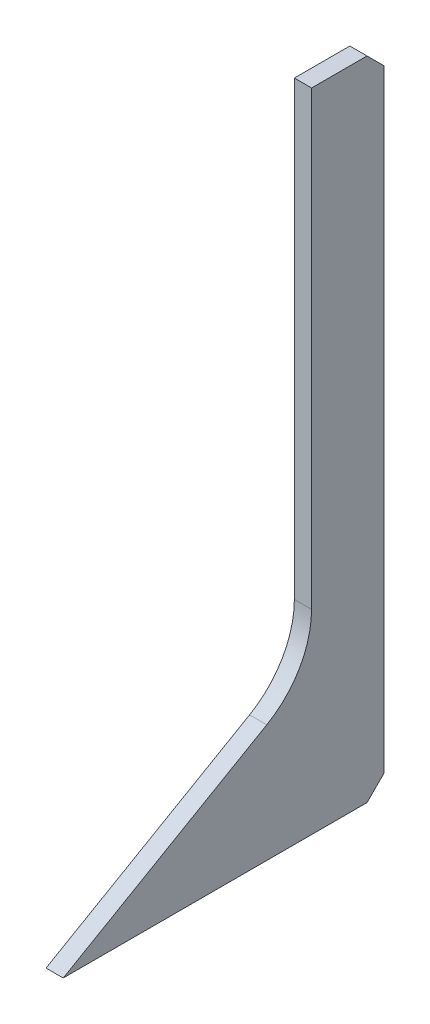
ISO-10303-21;
HEADER;
FILE_DESCRIPTION(('STEP AP214'),'2;1');
FILE_NAME('part.step','',(''),(''),'','','');
FILE_SCHEMA(('AUTOMOTIVE_DESIGN { 1 0 10303 214 1 1 1 1 }'));
ENDSEC;
DATA;
#1=APPLICATION_CONTEXT('core data for automotive mechanical design processes');
#2=APPLICATION_PROTOCOL_DEFINITION('international standard','automotive_design',2000,#1);
#3=PRODUCT_CONTEXT('',#1,'mechanical');
#4=PRODUCT('Part','Part','',(#3));
#5=PRODUCT_RELATED_PRODUCT_CATEGORY('part','',(#4));
#6=PRODUCT_DEFINITION_FORMATION('','',#4);
#7=PRODUCT_DEFINITION_CONTEXT('part definition',#1,'design');
#8=PRODUCT_DEFINITION('design','',#6,#7);
#9=PRODUCT_DEFINITION_SHAPE('','',#8);
#10=(LENGTH_UNIT() NAMED_UNIT(*) SI_UNIT(.MILLI.,.METRE.));
#11=(NAMED_UNIT(*) PLANE_ANGLE_UNIT() SI_UNIT($,.RADIAN.));
#12=(NAMED_UNIT(*) SI_UNIT($,.STERADIAN.) SOLID_ANGLE_UNIT());
#13=UNCERTAINTY_MEASURE_WITH_UNIT(LENGTH_MEASURE(1.E-05),#10,'distance_accuracy_value','');
#14=(GEOMETRIC_REPRESENTATION_CONTEXT(3) GLOBAL_UNCERTAINTY_ASSIGNED_CONTEXT((#13)) GLOBAL_UNIT_ASSIGNED_CONTEXT((#10,
#11,#12)) REPRESENTATION_CONTEXT('',''));
#15=CARTESIAN_POINT('',(0.,0.,0.));
#16=DIRECTION('',(0.,0.,1.));
#17=DIRECTION('',(1.,0.,0.));
#18=AXIS2_PLACEMENT_3D('',#15,#16,#17);
#19=CARTESIAN_POINT('',(384.582330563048,40.4827469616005,-255.534999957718));
#20=DIRECTION('',(0.,-1.,0.));
#21=DIRECTION('',(0.,0.,-1.));
#22=AXIS2_PLACEMENT_3D('',#19,#20,#21);
#23=PLANE('',#22);
#24=DIRECTION('',(1.,0.,0.));
#25=VECTOR('',#24,1.);
#26=CARTESIAN_POINT('',(384.582330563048,40.4827469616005,-253.534999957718));
#27=LINE('',#26,#25);
#28=CARTESIAN_POINT('',(384.582330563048,40.4827469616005,-253.534999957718));
#29=VERTEX_POINT('',#28);
#30=CARTESIAN_POINT('',(387.630330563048,40.4827469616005,-253.534999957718));
#31=VERTEX_POINT('',#30);
#32=EDGE_CURVE('E101',#29,#31,#27,.T.);
#33=ORIENTED_EDGE('',*,*,#32,.T.);
#34=DIRECTION('',(0.,0.,-1.));
#35=VECTOR('',#34,1.);
#36=CARTESIAN_POINT('',(387.630330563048,40.4827469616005,-255.534999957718));
#37=LINE('',#36,#35);
#38=CARTESIAN_POINT('',(387.630330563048,40.4827469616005,-199.713909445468));
#39=VERTEX_POINT('',#38);
#40=EDGE_CURVE('E121',#39,#31,#37,.T.);
#41=ORIENTED_EDGE('',*,*,#40,.F.);
#42=DIRECTION('',(1.,0.,0.));
#43=VECTOR('',#42,1.);
#44=CARTESIAN_POINT('',(384.582330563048,40.4827469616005,-199.713909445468));
#45=LINE('',#44,#43);
#46=CARTESIAN_POINT('',(384.582330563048,40.4827469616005,-199.713909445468));
#47=VERTEX_POINT('',#46);
#48=EDGE_CURVE('E146',#47,#39,#45,.T.);
#49=ORIENTED_EDGE('',*,*,#48,.F.);
#50=DIRECTION('',(0.,0.,-1.));
#51=VECTOR('',#50,1.);
#52=CARTESIAN_POINT('',(384.582330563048,40.4827469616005,-255.534999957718));
#53=LINE('',#52,#51);
#54=EDGE_CURVE('E135',#47,#29,#53,.T.);
#55=ORIENTED_EDGE('',*,*,#54,.T.);
#56=EDGE_LOOP('',(#33,#41,#49,#55));
#57=FACE_BOUND('',#56,.T.);
#58=ADVANCED_FACE('F35',(#57),#23,.T.);
#59=CARTESIAN_POINT('',(384.582330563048,65.8827469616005,-243.707999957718));
#60=DIRECTION('',(0.,0.866025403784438,0.500000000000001));
#61=DIRECTION('',(0.,-0.500000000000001,0.866025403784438));
#62=AXIS2_PLACEMENT_3D('',#59,#60,#61);
#63=PLANE('',#62);
#64=DIRECTION('',(0.,-0.500000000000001,0.866025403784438));
#65=VECTOR('',#64,1.);
#66=CARTESIAN_POINT('',(387.630330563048,65.8827469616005,-243.707999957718));
#67=LINE('',#66,#65);
#68=CARTESIAN_POINT('',(387.630330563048,61.3000291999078,-235.770499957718));
#69=VERTEX_POINT('',#68);
#70=EDGE_CURVE('E126',#69,#39,#67,.T.);
#71=ORIENTED_EDGE('',*,*,#70,.F.);
#72=DIRECTION('',(1.,0.,0.));
#73=VECTOR('',#72,1.);
#74=CARTESIAN_POINT('',(384.582330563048,61.3000291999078,-235.770499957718));
#75=LINE('',#74,#73);
#76=CARTESIAN_POINT('',(384.582330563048,61.3000291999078,-235.770499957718));
#77=VERTEX_POINT('',#76);
#78=EDGE_CURVE('E154',#69,#77,#75,.F.);
#79=ORIENTED_EDGE('',*,*,#78,.T.);
#80=DIRECTION('',(0.,-0.500000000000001,0.866025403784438));
#81=VECTOR('',#80,1.);
#82=CARTESIAN_POINT('',(384.582330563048,65.8827469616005,-243.707999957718));
#83=LINE('',#82,#81);
#84=EDGE_CURVE('E133',#77,#47,#83,.T.);
#85=ORIENTED_EDGE('',*,*,#84,.T.);
#86=ORIENTED_EDGE('',*,*,#48,.T.);
#87=EDGE_LOOP('',(#71,#79,#85,#86));
#88=FACE_BOUND('',#87,.T.);
#89=ADVANCED_FACE('F163',(#88),#63,.T.);
#90=CARTESIAN_POINT('',(384.582330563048,155.0367469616,-243.707999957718));
#91=DIRECTION('',(0.,0.,1.));
#92=DIRECTION('',(1.,0.,0.));
#93=AXIS2_PLACEMENT_3D('',#90,#91,#92);
#94=PLANE('',#93);
#95=DIRECTION('',(0.,-1.,0.));
#96=VECTOR('',#95,1.);
#97=CARTESIAN_POINT('',(384.582330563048,155.0367469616,-243.707999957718));
#98=LINE('',#97,#96);
#99=CARTESIAN_POINT('',(384.582330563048,155.0367469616,-243.707999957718));
#100=VERTEX_POINT('',#99);
#101=CARTESIAN_POINT('',(384.582330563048,75.0481824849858,-243.707999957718));
#102=VERTEX_POINT('',#101);
#103=EDGE_CURVE('E123',#100,#102,#98,.T.);
#104=ORIENTED_EDGE('',*,*,#103,.T.);
#105=DIRECTION('',(1.,0.,0.));
#106=VECTOR('',#105,1.);
#107=CARTESIAN_POINT('',(387.630330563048,75.0481824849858,-243.707999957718));
#108=LINE('',#107,#106);
#109=CARTESIAN_POINT('',(387.630330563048,75.0481824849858,-243.707999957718));
#110=VERTEX_POINT('',#109);
#111=EDGE_CURVE('E149',#102,#110,#108,.T.);
#112=ORIENTED_EDGE('',*,*,#111,.T.);
#113=DIRECTION('',(0.,-1.,0.));
#114=VECTOR('',#113,1.);
#115=CARTESIAN_POINT('',(387.630330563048,155.0367469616,-243.707999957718));
#116=LINE('',#115,#114);
#117=CARTESIAN_POINT('',(387.630330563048,155.0367469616,-243.707999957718));
#118=VERTEX_POINT('',#117);
#119=EDGE_CURVE('E142',#118,#110,#116,.T.);
#120=ORIENTED_EDGE('',*,*,#119,.F.);
#121=DIRECTION('',(1.,0.,0.));
#122=VECTOR('',#121,1.);
#123=CARTESIAN_POINT('',(384.582330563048,155.0367469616,-243.707999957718));
#124=LINE('',#123,#122);
#125=EDGE_CURVE('E137',#100,#118,#124,.T.);
#126=ORIENTED_EDGE('',*,*,#125,.F.);
#127=EDGE_LOOP('',(#104,#112,#120,#126));
#128=FACE_BOUND('',#127,.T.);
#129=ADVANCED_FACE('F171',(#128),#94,.T.);
#130=CARTESIAN_POINT('',(384.582330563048,155.0367469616,-243.707999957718));
#131=DIRECTION('',(0.,1.,0.));
#132=DIRECTION('',(0.,0.,1.));
#133=AXIS2_PLACEMENT_3D('',#130,#131,#132);
#134=PLANE('',#133);
#135=DIRECTION('',(1.,0.,0.));
#136=VECTOR('',#135,1.);
#137=CARTESIAN_POINT('',(384.582330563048,155.0367469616,-253.534999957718));
#138=LINE('',#137,#136);
#139=CARTESIAN_POINT('',(384.582330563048,155.0367469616,-253.534999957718));
#140=VERTEX_POINT('',#139);
#141=CARTESIAN_POINT('',(387.630330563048,155.0367469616,-253.534999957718));
#142=VERTEX_POINT('',#141);
#143=EDGE_CURVE('E58',#140,#142,#138,.T.);
#144=ORIENTED_EDGE('',*,*,#143,.F.);
#145=DIRECTION('',(0.,0.,1.));
#146=VECTOR('',#145,1.);
#147=CARTESIAN_POINT('',(384.582330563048,155.0367469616,-243.707999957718));
#148=LINE('',#147,#146);
#149=EDGE_CURVE('E120',#140,#100,#148,.T.);
#150=ORIENTED_EDGE('',*,*,#149,.T.);
#151=ORIENTED_EDGE('',*,*,#125,.T.);
#152=DIRECTION('',(0.,0.,1.));
#153=VECTOR('',#152,1.);
#154=CARTESIAN_POINT('',(387.630330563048,155.0367469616,-243.707999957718));
#155=LINE('',#154,#153);
#156=EDGE_CURVE('E139',#142,#118,#155,.T.);
#157=ORIENTED_EDGE('',*,*,#156,.F.);
#158=EDGE_LOOP('',(#144,#150,#151,#157));
#159=FACE_BOUND('',#158,.T.);
#160=ADVANCED_FACE('F174',(#159),#134,.T.);
#161=CARTESIAN_POINT('',(384.582330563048,154.0367469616,-256.534999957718));
#162=DIRECTION('',(0.,0.,-1.));
#163=DIRECTION('',(-1.,0.,0.));
#164=AXIS2_PLACEMENT_3D('',#161,#162,#163);
#165=PLANE('',#164);
#166=DIRECTION('',(1.,0.,0.));
#167=VECTOR('',#166,1.);
#168=CARTESIAN_POINT('',(384.582330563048,43.4827469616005,-256.534999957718));
#169=LINE('',#168,#167);
#170=CARTESIAN_POINT('',(384.582330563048,43.4827469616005,-256.534999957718));
#171=VERTEX_POINT('',#170);
#172=CARTESIAN_POINT('',(387.630330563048,43.4827469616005,-256.534999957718));
#173=VERTEX_POINT('',#172);
#174=EDGE_CURVE('E50',#171,#173,#169,.T.);
#175=ORIENTED_EDGE('',*,*,#174,.F.);
#176=DIRECTION('',(0.,1.,0.));
#177=VECTOR('',#176,1.);
#178=CARTESIAN_POINT('',(384.582330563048,154.0367469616,-256.534999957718));
#179=LINE('',#178,#177);
#180=CARTESIAN_POINT('',(384.582330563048,152.0367469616,-256.534999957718));
#181=VERTEX_POINT('',#180);
#182=EDGE_CURVE('E112',#171,#181,#179,.T.);
#183=ORIENTED_EDGE('',*,*,#182,.T.);
#184=DIRECTION('',(1.,0.,0.));
#185=VECTOR('',#184,1.);
#186=CARTESIAN_POINT('',(384.582330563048,152.0367469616,-256.534999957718));
#187=LINE('',#186,#185);
#188=CARTESIAN_POINT('',(387.630330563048,152.0367469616,-256.534999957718));
#189=VERTEX_POINT('',#188);
#190=EDGE_CURVE('E140',#181,#189,#187,.T.);
#191=ORIENTED_EDGE('',*,*,#190,.T.);
#192=DIRECTION('',(0.,1.,0.));
#193=VECTOR('',#192,1.);
#194=CARTESIAN_POINT('',(387.630330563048,154.0367469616,-256.534999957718));
#195=LINE('',#194,#193);
#196=EDGE_CURVE('E114',#173,#189,#195,.T.);
#197=ORIENTED_EDGE('',*,*,#196,.F.);
#198=EDGE_LOOP('',(#175,#183,#191,#197));
#199=FACE_BOUND('',#198,.T.);
#200=ADVANCED_FACE('F110',(#199),#165,.T.);
#201=CARTESIAN_POINT('',(384.582330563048,41.4827469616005,-255.534999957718));
#202=DIRECTION('',(1.,0.,0.));
#203=DIRECTION('',(0.,0.,-1.));
#204=AXIS2_PLACEMENT_3D('',#201,#202,#203);
#205=PLANE('',#204);
#206=ORIENTED_EDGE('',*,*,#182,.F.);
#207=DIRECTION('',(0.,-0.707106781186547,0.707106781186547));
#208=VECTOR('',#207,1.);
#209=CARTESIAN_POINT('',(384.582330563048,43.4827469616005,-256.534999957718));
#210=LINE('',#209,#208);
#211=EDGE_CURVE('E98',#171,#29,#210,.T.);
#212=ORIENTED_EDGE('',*,*,#211,.T.);
#213=ORIENTED_EDGE('',*,*,#54,.F.);
#214=ORIENTED_EDGE('',*,*,#84,.F.);
#215=CARTESIAN_POINT('',(384.582330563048,75.0481824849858,-227.832999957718));
#216=DIRECTION('',(1.,0.,0.));
#217=DIRECTION('',(0.,0.,-1.));
#218=AXIS2_PLACEMENT_3D('',#215,#216,#217);
#219=CIRCLE('',#218,15.875);
#220=EDGE_CURVE('E11',#77,#102,#219,.T.);
#221=ORIENTED_EDGE('',*,*,#220,.T.);
#222=ORIENTED_EDGE('',*,*,#103,.F.);
#223=ORIENTED_EDGE('',*,*,#149,.F.);
#224=DIRECTION('',(0.,-0.707106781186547,-0.707106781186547));
#225=VECTOR('',#224,1.);
#226=CARTESIAN_POINT('',(384.582330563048,155.0367469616,-253.534999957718));
#227=LINE('',#226,#225);
#228=EDGE_CURVE('E119',#140,#181,#227,.T.);
#229=ORIENTED_EDGE('',*,*,#228,.T.);
#230=EDGE_LOOP('',(#206,#212,#213,#214,#221,#222,#223,#229));
#231=FACE_BOUND('',#230,.T.);
#232=ADVANCED_FACE('F117',(#231),#205,.F.);
#233=CARTESIAN_POINT('',(387.630330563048,41.4827469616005,-255.534999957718));
#234=DIRECTION('',(1.,0.,0.));
#235=DIRECTION('',(0.,0.,-1.));
#236=AXIS2_PLACEMENT_3D('',#233,#234,#235);
#237=PLANE('',#236);
#238=DIRECTION('',(0.,-0.707106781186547,0.707106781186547));
#239=VECTOR('',#238,1.);
#240=CARTESIAN_POINT('',(387.630330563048,43.4827469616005,-256.534999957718));
#241=LINE('',#240,#239);
#242=EDGE_CURVE('E106',#173,#31,#241,.T.);
#243=ORIENTED_EDGE('',*,*,#242,.F.);
#244=ORIENTED_EDGE('',*,*,#196,.T.);
#245=DIRECTION('',(0.,-0.707106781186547,-0.707106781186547));
#246=VECTOR('',#245,1.);
#247=CARTESIAN_POINT('',(387.630330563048,155.0367469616,-253.534999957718));
#248=LINE('',#247,#246);
#249=EDGE_CURVE('E175',#142,#189,#248,.T.);
#250=ORIENTED_EDGE('',*,*,#249,.F.);
#251=ORIENTED_EDGE('',*,*,#156,.T.);
#252=ORIENTED_EDGE('',*,*,#119,.T.);
#253=CARTESIAN_POINT('',(387.630330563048,75.0481824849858,-227.832999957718));
#254=DIRECTION('',(1.,0.,0.));
#255=DIRECTION('',(0.,0.,-1.));
#256=AXIS2_PLACEMENT_3D('',#253,#254,#255);
#257=CIRCLE('',#256,15.875);
#258=EDGE_CURVE('E43',#110,#69,#257,.F.);
#259=ORIENTED_EDGE('',*,*,#258,.T.);
#260=ORIENTED_EDGE('',*,*,#70,.T.);
#261=ORIENTED_EDGE('',*,*,#40,.T.);
#262=EDGE_LOOP('',(#243,#244,#250,#251,#252,#259,#260,#261));
#263=FACE_BOUND('',#262,.T.);
#264=ADVANCED_FACE('F157',(#263),#237,.T.);
#265=CARTESIAN_POINT('',(384.582330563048,75.0481824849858,-227.832999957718));
#266=DIRECTION('',(-1.,0.,0.));
#267=DIRECTION('',(0.,0.,1.));
#268=AXIS2_PLACEMENT_3D('',#265,#266,#267);
#269=CYLINDRICAL_SURFACE('',#268,15.875);
#270=ORIENTED_EDGE('',*,*,#220,.F.);
#271=ORIENTED_EDGE('',*,*,#78,.F.);
#272=ORIENTED_EDGE('',*,*,#258,.F.);
#273=ORIENTED_EDGE('',*,*,#111,.F.);
#274=EDGE_LOOP('',(#270,#271,#272,#273));
#275=FACE_BOUND('',#274,.T.);
#276=ADVANCED_FACE('F37',(#275),#269,.F.);
#277=CARTESIAN_POINT('',(384.582330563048,155.0367469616,-253.534999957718));
#278=DIRECTION('',(0.,-0.707106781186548,0.707106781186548));
#279=DIRECTION('',(0.,-0.707106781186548,-0.707106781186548));
#280=AXIS2_PLACEMENT_3D('',#277,#278,#279);
#281=PLANE('',#280);
#282=ORIENTED_EDGE('',*,*,#249,.T.);
#283=ORIENTED_EDGE('',*,*,#190,.F.);
#284=ORIENTED_EDGE('',*,*,#228,.F.);
#285=ORIENTED_EDGE('',*,*,#143,.T.);
#286=EDGE_LOOP('',(#282,#283,#284,#285));
#287=FACE_BOUND('',#286,.T.);
#288=ADVANCED_FACE('F201',(#287),#281,.F.);
#289=CARTESIAN_POINT('',(384.582330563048,43.4827469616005,-256.534999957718));
#290=DIRECTION('',(0.,0.707106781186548,0.707106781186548));
#291=DIRECTION('',(0.,-0.707106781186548,0.707106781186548));
#292=AXIS2_PLACEMENT_3D('',#289,#290,#291);
#293=PLANE('',#292);
#294=ORIENTED_EDGE('',*,*,#242,.T.);
#295=ORIENTED_EDGE('',*,*,#32,.F.);
#296=ORIENTED_EDGE('',*,*,#211,.F.);
#297=ORIENTED_EDGE('',*,*,#174,.T.);
#298=EDGE_LOOP('',(#294,#295,#296,#297));
#299=FACE_BOUND('',#298,.T.);
#300=ADVANCED_FACE('F99',(#299),#293,.F.);
#301=CLOSED_SHELL('',(#58,#89,#129,#160,#200,#232,#264,#276,#288,#300));
#302=MANIFOLD_SOLID_BREP('B2',#301);
#303=ADVANCED_BREP_SHAPE_REPRESENTATION('',(#18,#302),#14);
#304=SHAPE_DEFINITION_REPRESENTATION(#9,#303);
ENDSEC;
END-ISO-10303-21;
